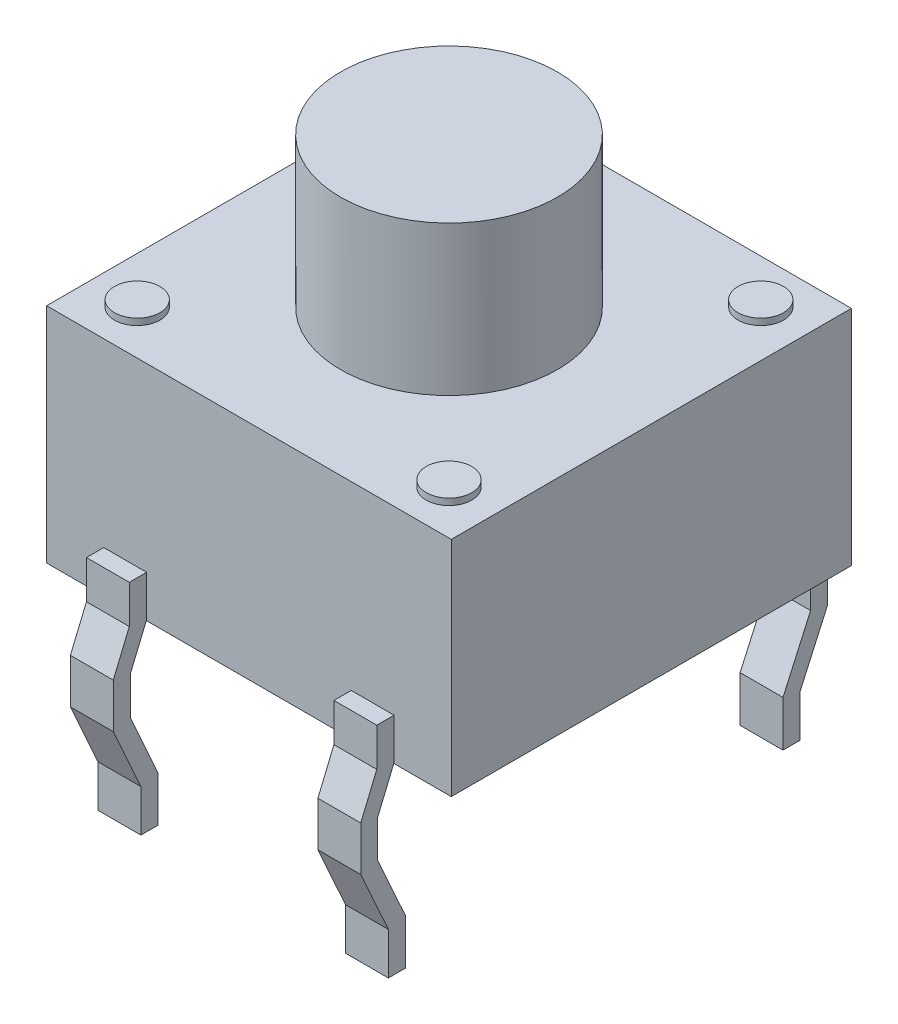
from build123d import *

# Parameters (mm, degrees)
ESQUISSE1_W               = 6.23
ESQUISSE1_H               = 6.16
EXTRUSION1_DEPTH          = 3.43
ESQUISSE2_R               = 1.67
EXTRUSION2_DEPTH          = 2.3
ESQUISSE3_W               = 0.66
ESQUISSE3_H               = 0.261460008
SYM_TRIE2_COPY_1_SKETCH_W = 0.66
SYM_TRIE2_COPY_1_SKETCH_H = 0.261460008
ESQUISSE5_R               = 0.35
EXTRUSION3_DEPTH          = 0.1


with BuildPart() as part:
    # Esquisse1 → Extrusion1 (new body)
    with BuildSketch(Plane(origin=(0, 0, 0), x_dir=(1, 0, 0), z_dir=(0, 1, 0))):
        Rectangle(ESQUISSE1_W, ESQUISSE1_H)
    extrude(amount=EXTRUSION1_DEPTH)

    # Esquisse2 → Extrusion2 (add)
    with BuildSketch(Plane(origin=(0, 3.43, 0), x_dir=(-1, 0, 0), z_dir=(0, 1, 0))):
        with Locations(Location((0, 0, 0), (0, 0, 270))):
            Circle(ESQUISSE2_R)
    extrude(amount=EXTRUSION2_DEPTH)

    # Balayage1: sweep along a path in Esquisse4
    with BuildLine(Plane(origin=(1.575, 0, 0), x_dir=(0, 0, -1), z_dir=(1, 0, 0))) as balayage1_path:
        Line((-2.877614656, 0.502870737), (-3.203673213, 0.502870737))
        Line((-3.203673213, 0.502870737), (-3.203673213, 0.027900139))
        Line((-3.203673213, 0.027900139), (-3.450375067, -0.563178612))
        Line((-3.450375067, -0.563178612), (-3.450375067, -1.191085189))
        Line((-3.450375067, -1.191085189), (-3.025266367, -2.135488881))
        Line((-3.025266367, -2.135488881), (-3.025266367, -2.813786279))
    # Esquisse3 → Balayage1 (sweep)
    with BuildSketch(Plane.XY.offset(3.08)):
        with Locations((1.905, 0.515156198)):
            Rectangle(ESQUISSE3_W, ESQUISSE3_H)
    balayage1 = sweep(path=balayage1_path.line, transition=Transition.RIGHT)

    # Sym_trie1: Balayage1 across plane
    add(balayage1.mirror(Plane(origin=(0, 0, 0), x_dir=(0, 0, 1), z_dir=(1, 0, 0))))

    # Sym_trie2: Balayage1 across plane
    add(balayage1.mirror(Plane.XY))

    # Sym_trie2 copy 1: sweep along a path in Sym_trie2 copy 1 path
    with BuildLine(Plane.ZY.offset(1.575)) as sym_trie2_copy_1_path:
        Line((-2.877614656, 0.502870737), (-3.203673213, 0.502870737))
        Line((-3.203673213, 0.502870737), (-3.203673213, 0.027900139))
        Line((-3.203673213, 0.027900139), (-3.450375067, -0.563178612))
        Line((-3.450375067, -0.563178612), (-3.450375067, -1.191085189))
        Line((-3.450375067, -1.191085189), (-3.025266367, -2.135488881))
        Line((-3.025266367, -2.135488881), (-3.025266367, -2.813786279))
    # Sym_trie2 copy 1 sketch → Sym_trie2 copy 1 (sweep)
    with BuildSketch(Plane(origin=(0, 0, -3.08), x_dir=(-1, 0, 0), z_dir=(0, 0, -1))):
        with Locations((1.905, 0.515156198)):
            Rectangle(SYM_TRIE2_COPY_1_SKETCH_W, SYM_TRIE2_COPY_1_SKETCH_H)
    sweep(path=sym_trie2_copy_1_path.line, transition=Transition.RIGHT)

    # Esquisse5 → Extrusion3 (add)
    with BuildSketch(Plane(origin=(0, 3.43, 0), x_dir=(-1, 0, 0), z_dir=(0, 1, 0))):
        with Locations(Location((-2.400025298, 2.400025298, 0), (0, 0, 270))):
            Circle(ESQUISSE5_R)
        with Locations(Location((-2.400025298, -2.400025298, 0), (0, 0, 270))):
            Circle(ESQUISSE5_R)
        with Locations(Location((2.400025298, -2.400025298, 0), (0, 0, 270))):
            Circle(ESQUISSE5_R)
        with Locations(Location((2.400025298, 2.400025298, 0), (0, 0, 270))):
            Circle(ESQUISSE5_R)
    extrude(amount=EXTRUSION3_DEPTH)


solid = part.part
